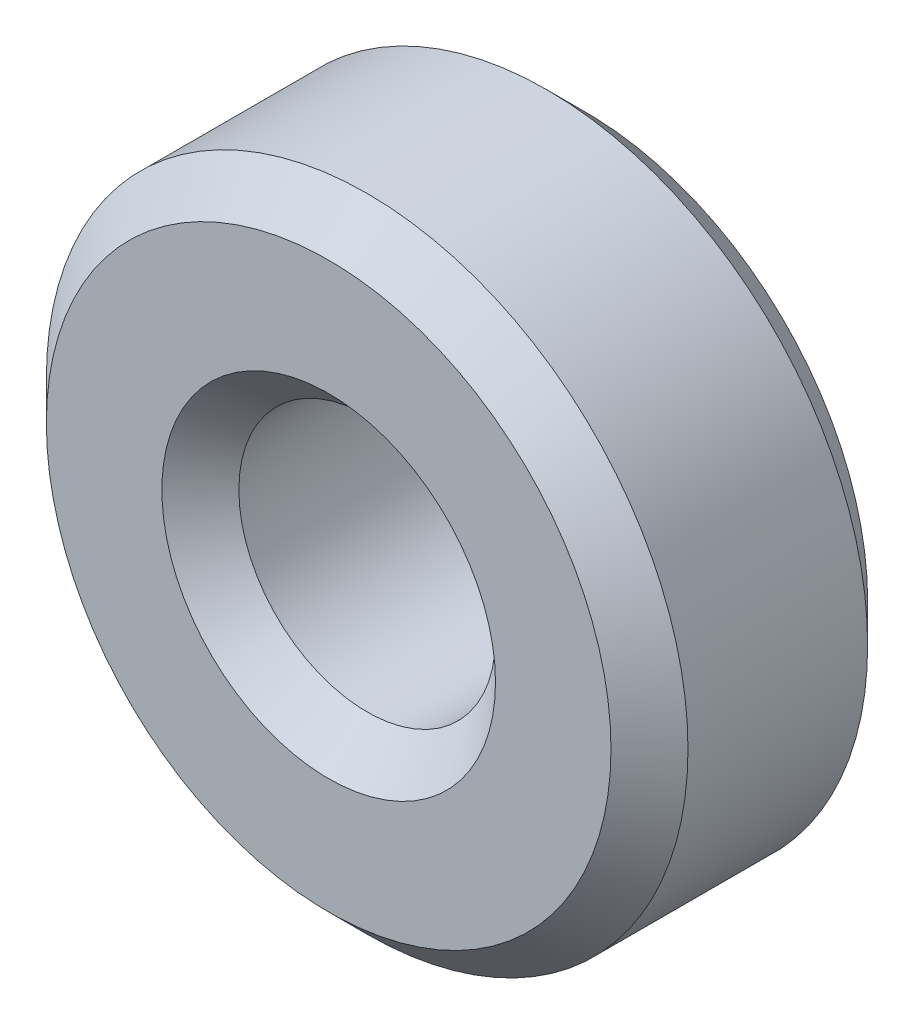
from build123d import *

# Parameters (mm, degrees)
ESQUISSE1_R          = 2.5
ESQUISSE1_R_2        = 1
BASE_EXTRUSION_DEPTH = 2
CHANFREIN1_SIZE      = 0.3


with BuildPart() as part:
    # Esquisse1 → Base-Extrusion (new body)
    with BuildSketch(Plane.XY):
        Circle(ESQUISSE1_R)
        Circle(ESQUISSE1_R_2, mode=Mode.SUBTRACT)
    extrude(amount=BASE_EXTRUSION_DEPTH)

    # Chanfrein1
    chanfrein1_edges = [part.edges().sort_by_distance(p)[0] for p in [
        (-2.5, 0, 0),
        (-2.5, 0, 2),
        (-1, 0, 0),
        (-1, 0, 2),
    ]]
    chamfer(chanfrein1_edges, length=CHANFREIN1_SIZE)


solid = part.part
